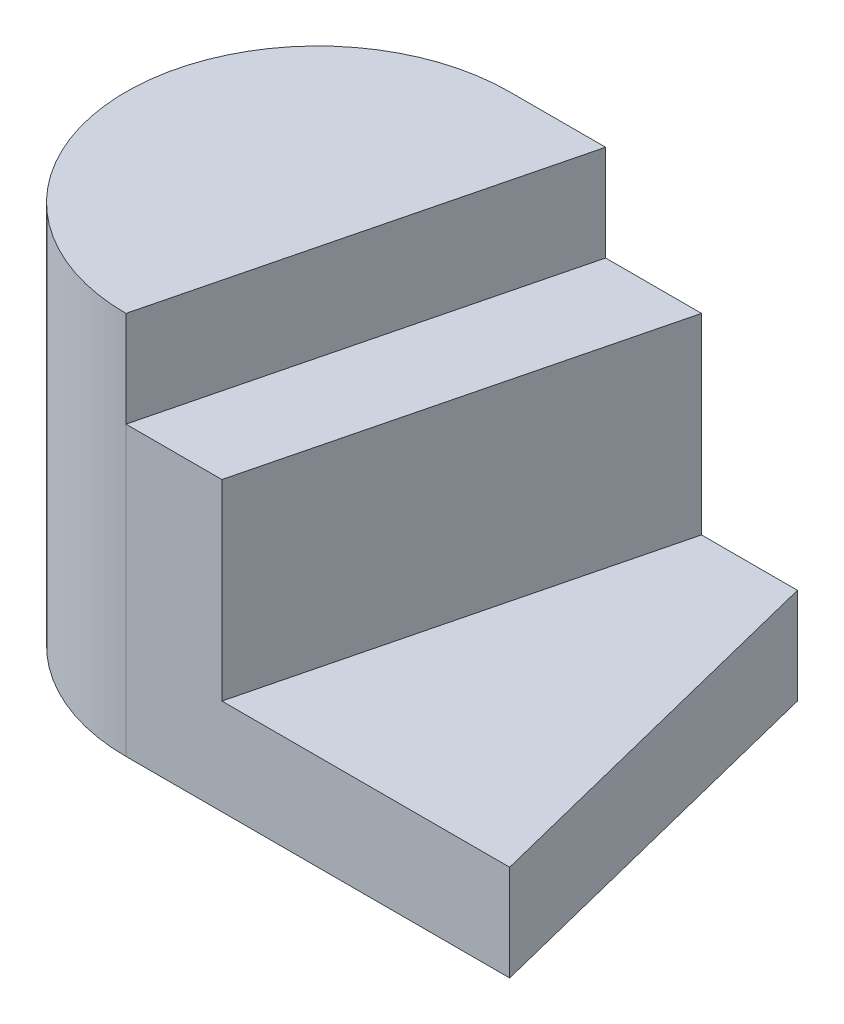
ISO-10303-21;
HEADER;
FILE_DESCRIPTION(('STEP AP214'),'2;1');
FILE_NAME('part.step','',(''),(''),'','','');
FILE_SCHEMA(('AUTOMOTIVE_DESIGN { 1 0 10303 214 1 1 1 1 }'));
ENDSEC;
DATA;
#1=APPLICATION_CONTEXT('core data for automotive mechanical design processes');
#2=APPLICATION_PROTOCOL_DEFINITION('international standard','automotive_design',2000,#1);
#3=PRODUCT_CONTEXT('',#1,'mechanical');
#4=PRODUCT('Part','Part','',(#3));
#5=PRODUCT_RELATED_PRODUCT_CATEGORY('part','',(#4));
#6=PRODUCT_DEFINITION_FORMATION('','',#4);
#7=PRODUCT_DEFINITION_CONTEXT('part definition',#1,'design');
#8=PRODUCT_DEFINITION('design','',#6,#7);
#9=PRODUCT_DEFINITION_SHAPE('','',#8);
#10=(LENGTH_UNIT() NAMED_UNIT(*) SI_UNIT(.MILLI.,.METRE.));
#11=(NAMED_UNIT(*) PLANE_ANGLE_UNIT() SI_UNIT($,.RADIAN.));
#12=(NAMED_UNIT(*) SI_UNIT($,.STERADIAN.) SOLID_ANGLE_UNIT());
#13=UNCERTAINTY_MEASURE_WITH_UNIT(LENGTH_MEASURE(1.E-05),#10,'distance_accuracy_value','');
#14=(GEOMETRIC_REPRESENTATION_CONTEXT(3) GLOBAL_UNCERTAINTY_ASSIGNED_CONTEXT((#13)) GLOBAL_UNIT_ASSIGNED_CONTEXT((#10,
#11,#12)) REPRESENTATION_CONTEXT('',''));
#15=CARTESIAN_POINT('',(0.,0.,0.));
#16=DIRECTION('',(0.,0.,1.));
#17=DIRECTION('',(1.,0.,0.));
#18=AXIS2_PLACEMENT_3D('',#15,#16,#17);
#19=CARTESIAN_POINT('',(-46.230636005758,40.,-20.));
#20=DIRECTION('',(0.,0.,-1.));
#21=DIRECTION('',(-1.,0.,0.));
#22=AXIS2_PLACEMENT_3D('',#19,#20,#21);
#23=PLANE('',#22);
#24=DIRECTION('',(1.,0.,0.));
#25=VECTOR('',#24,1.);
#26=CARTESIAN_POINT('',(-46.230636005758,0.,-20.));
#27=LINE('',#26,#25);
#28=CARTESIAN_POINT('',(0.,0.,-20.));
#29=VERTEX_POINT('',#28);
#30=CARTESIAN_POINT('',(30.,0.,-20.));
#31=VERTEX_POINT('',#30);
#32=EDGE_CURVE('E82',#29,#31,#27,.T.);
#33=ORIENTED_EDGE('',*,*,#32,.F.);
#34=DIRECTION('',(0.,-1.,0.));
#35=VECTOR('',#34,1.);
#36=CARTESIAN_POINT('',(0.,40.,-20.));
#37=LINE('',#36,#35);
#38=CARTESIAN_POINT('',(0.,40.,-20.));
#39=VERTEX_POINT('',#38);
#40=EDGE_CURVE('E11',#39,#29,#37,.T.);
#41=ORIENTED_EDGE('',*,*,#40,.F.);
#42=DIRECTION('',(1.,0.,0.));
#43=VECTOR('',#42,1.);
#44=CARTESIAN_POINT('',(-46.230636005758,40.,-20.));
#45=LINE('',#44,#43);
#46=CARTESIAN_POINT('',(9.99999999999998,40.,-20.));
#47=VERTEX_POINT('',#46);
#48=EDGE_CURVE('E78',#39,#47,#45,.T.);
#49=ORIENTED_EDGE('',*,*,#48,.T.);
#50=DIRECTION('',(0.,-1.,0.));
#51=VECTOR('',#50,1.);
#52=CARTESIAN_POINT('',(9.99999999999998,40.,-20.));
#53=LINE('',#52,#51);
#54=CARTESIAN_POINT('',(9.99999999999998,30.,-20.));
#55=VERTEX_POINT('',#54);
#56=EDGE_CURVE('E48',#47,#55,#53,.T.);
#57=ORIENTED_EDGE('',*,*,#56,.T.);
#58=DIRECTION('',(1.,0.,0.));
#59=VECTOR('',#58,1.);
#60=CARTESIAN_POINT('',(-46.230636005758,30.,-20.));
#61=LINE('',#60,#59);
#62=CARTESIAN_POINT('',(20.,30.,-20.));
#63=VERTEX_POINT('',#62);
#64=EDGE_CURVE('E144',#55,#63,#61,.T.);
#65=ORIENTED_EDGE('',*,*,#64,.T.);
#66=DIRECTION('',(0.,-1.,0.));
#67=VECTOR('',#66,1.);
#68=CARTESIAN_POINT('',(20.,30.,-20.));
#69=LINE('',#68,#67);
#70=CARTESIAN_POINT('',(20.,10.,-20.));
#71=VERTEX_POINT('',#70);
#72=EDGE_CURVE('E69',#63,#71,#69,.T.);
#73=ORIENTED_EDGE('',*,*,#72,.T.);
#74=DIRECTION('',(1.,0.,0.));
#75=VECTOR('',#74,1.);
#76=CARTESIAN_POINT('',(-46.230636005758,10.,-20.));
#77=LINE('',#76,#75);
#78=CARTESIAN_POINT('',(30.,10.,-20.));
#79=VERTEX_POINT('',#78);
#80=EDGE_CURVE('E130',#71,#79,#77,.T.);
#81=ORIENTED_EDGE('',*,*,#80,.T.);
#82=DIRECTION('',(0.,-1.,0.));
#83=VECTOR('',#82,1.);
#84=CARTESIAN_POINT('',(30.,10.,-20.));
#85=LINE('',#84,#83);
#86=EDGE_CURVE('E159',#79,#31,#85,.T.);
#87=ORIENTED_EDGE('',*,*,#86,.T.);
#88=EDGE_LOOP('',(#33,#41,#49,#57,#65,#73,#81,#87));
#89=FACE_BOUND('',#88,.T.);
#90=ADVANCED_FACE('F32',(#89),#23,.T.);
#91=CARTESIAN_POINT('',(0.,40.,0.));
#92=DIRECTION('',(0.,-1.,0.));
#93=DIRECTION('',(0.,0.,-1.));
#94=AXIS2_PLACEMENT_3D('',#91,#92,#93);
#95=CYLINDRICAL_SURFACE('',#94,20.);
#96=CARTESIAN_POINT('',(0.,0.,0.));
#97=DIRECTION('',(0.,1.,0.));
#98=DIRECTION('',(0.,0.,1.));
#99=AXIS2_PLACEMENT_3D('',#96,#97,#98);
#100=CIRCLE('',#99,20.);
#101=CARTESIAN_POINT('',(0.,0.,20.));
#102=VERTEX_POINT('',#101);
#103=EDGE_CURVE('E92',#29,#102,#100,.T.);
#104=ORIENTED_EDGE('',*,*,#103,.T.);
#105=DIRECTION('',(0.,-1.,0.));
#106=VECTOR('',#105,1.);
#107=CARTESIAN_POINT('',(0.,30.,20.));
#108=LINE('',#107,#106);
#109=CARTESIAN_POINT('',(0.,30.,20.));
#110=VERTEX_POINT('',#109);
#111=EDGE_CURVE('E96',#110,#102,#108,.T.);
#112=ORIENTED_EDGE('',*,*,#111,.F.);
#113=DIRECTION('',(0.,-1.,0.));
#114=VECTOR('',#113,1.);
#115=CARTESIAN_POINT('',(0.,40.,20.));
#116=LINE('',#115,#114);
#117=CARTESIAN_POINT('',(0.,40.,20.));
#118=VERTEX_POINT('',#117);
#119=EDGE_CURVE('E40',#118,#110,#116,.T.);
#120=ORIENTED_EDGE('',*,*,#119,.F.);
#121=CARTESIAN_POINT('',(0.,40.,0.));
#122=DIRECTION('',(0.,1.,0.));
#123=DIRECTION('',(0.,0.,1.));
#124=AXIS2_PLACEMENT_3D('',#121,#122,#123);
#125=CIRCLE('',#124,20.);
#126=EDGE_CURVE('E84',#39,#118,#125,.T.);
#127=ORIENTED_EDGE('',*,*,#126,.F.);
#128=ORIENTED_EDGE('',*,*,#40,.T.);
#129=EDGE_LOOP('',(#104,#112,#120,#127,#128));
#130=FACE_BOUND('',#129,.T.);
#131=ADVANCED_FACE('F85',(#130),#95,.T.);
#132=CARTESIAN_POINT('',(1.98643317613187,40.,12.0542672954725));
#133=DIRECTION('',(0.970142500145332,0.,0.242535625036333));
#134=DIRECTION('',(0.242535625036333,0.,-0.970142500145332));
#135=AXIS2_PLACEMENT_3D('',#132,#133,#134);
#136=PLANE('',#135);
#137=DIRECTION('',(-0.242535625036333,0.,0.970142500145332));
#138=VECTOR('',#137,1.);
#139=CARTESIAN_POINT('',(1.98643317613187,30.,12.0542672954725));
#140=LINE('',#139,#138);
#141=EDGE_CURVE('E104',#55,#110,#140,.T.);
#142=ORIENTED_EDGE('',*,*,#141,.F.);
#143=ORIENTED_EDGE('',*,*,#56,.F.);
#144=DIRECTION('',(-0.242535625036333,0.,0.970142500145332));
#145=VECTOR('',#144,1.);
#146=CARTESIAN_POINT('',(1.98643317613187,40.,12.0542672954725));
#147=LINE('',#146,#145);
#148=EDGE_CURVE('E89',#47,#118,#147,.T.);
#149=ORIENTED_EDGE('',*,*,#148,.T.);
#150=ORIENTED_EDGE('',*,*,#119,.T.);
#151=EDGE_LOOP('',(#142,#143,#149,#150));
#152=FACE_BOUND('',#151,.T.);
#153=ADVANCED_FACE('F101',(#152),#136,.T.);
#154=CARTESIAN_POINT('',(-46.230636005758,40.,0.));
#155=DIRECTION('',(0.,1.,0.));
#156=DIRECTION('',(0.,0.,1.));
#157=AXIS2_PLACEMENT_3D('',#154,#155,#156);
#158=PLANE('',#157);
#159=ORIENTED_EDGE('',*,*,#48,.F.);
#160=ORIENTED_EDGE('',*,*,#126,.T.);
#161=ORIENTED_EDGE('',*,*,#148,.F.);
#162=EDGE_LOOP('',(#159,#160,#161));
#163=FACE_BOUND('',#162,.T.);
#164=ADVANCED_FACE('F91',(#163),#158,.T.);
#165=CARTESIAN_POINT('',(-46.230636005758,0.,0.));
#166=DIRECTION('',(0.,1.,0.));
#167=DIRECTION('',(0.,0.,1.));
#168=AXIS2_PLACEMENT_3D('',#165,#166,#167);
#169=PLANE('',#168);
#170=ORIENTED_EDGE('',*,*,#32,.T.);
#171=DIRECTION('',(0.242535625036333,0.,0.970142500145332));
#172=VECTOR('',#171,1.);
#173=CARTESIAN_POINT('',(30.2217272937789,0.,-19.1130908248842));
#174=LINE('',#173,#172);
#175=CARTESIAN_POINT('',(40.,0.,20.));
#176=VERTEX_POINT('',#175);
#177=EDGE_CURVE('E137',#31,#176,#174,.T.);
#178=ORIENTED_EDGE('',*,*,#177,.T.);
#179=DIRECTION('',(-1.,0.,0.));
#180=VECTOR('',#179,1.);
#181=CARTESIAN_POINT('',(-46.230636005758,0.,20.));
#182=LINE('',#181,#180);
#183=EDGE_CURVE('E151',#176,#102,#182,.T.);
#184=ORIENTED_EDGE('',*,*,#183,.T.);
#185=ORIENTED_EDGE('',*,*,#103,.F.);
#186=EDGE_LOOP('',(#170,#178,#184,#185));
#187=FACE_BOUND('',#186,.T.);
#188=ADVANCED_FACE('F170',(#187),#169,.F.);
#189=CARTESIAN_POINT('',(-46.230636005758,30.,20.));
#190=DIRECTION('',(0.,0.,1.));
#191=DIRECTION('',(1.,0.,0.));
#192=AXIS2_PLACEMENT_3D('',#189,#190,#191);
#193=PLANE('',#192);
#194=ORIENTED_EDGE('',*,*,#183,.F.);
#195=DIRECTION('',(0.,-1.,0.));
#196=VECTOR('',#195,1.);
#197=CARTESIAN_POINT('',(40.,10.,20.));
#198=LINE('',#197,#196);
#199=CARTESIAN_POINT('',(40.,10.,20.));
#200=VERTEX_POINT('',#199);
#201=EDGE_CURVE('E152',#200,#176,#198,.T.);
#202=ORIENTED_EDGE('',*,*,#201,.F.);
#203=DIRECTION('',(-1.,0.,0.));
#204=VECTOR('',#203,1.);
#205=CARTESIAN_POINT('',(-46.230636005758,10.,20.));
#206=LINE('',#205,#204);
#207=CARTESIAN_POINT('',(9.99999999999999,10.,20.));
#208=VERTEX_POINT('',#207);
#209=EDGE_CURVE('E142',#200,#208,#206,.T.);
#210=ORIENTED_EDGE('',*,*,#209,.T.);
#211=DIRECTION('',(0.,-1.,0.));
#212=VECTOR('',#211,1.);
#213=CARTESIAN_POINT('',(9.99999999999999,30.,20.));
#214=LINE('',#213,#212);
#215=CARTESIAN_POINT('',(9.99999999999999,30.,20.));
#216=VERTEX_POINT('',#215);
#217=EDGE_CURVE('E141',#216,#208,#214,.T.);
#218=ORIENTED_EDGE('',*,*,#217,.F.);
#219=DIRECTION('',(-1.,0.,0.));
#220=VECTOR('',#219,1.);
#221=CARTESIAN_POINT('',(-46.230636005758,30.,20.));
#222=LINE('',#221,#220);
#223=EDGE_CURVE('E148',#216,#110,#222,.T.);
#224=ORIENTED_EDGE('',*,*,#223,.T.);
#225=ORIENTED_EDGE('',*,*,#111,.T.);
#226=EDGE_LOOP('',(#194,#202,#210,#218,#224,#225));
#227=FACE_BOUND('',#226,.T.);
#228=ADVANCED_FACE('F165',(#227),#193,.T.);
#229=CARTESIAN_POINT('',(11.3981978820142,30.,14.407208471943));
#230=DIRECTION('',(0.970142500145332,0.,0.242535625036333));
#231=DIRECTION('',(0.242535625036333,0.,-0.970142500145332));
#232=AXIS2_PLACEMENT_3D('',#229,#230,#231);
#233=PLANE('',#232);
#234=DIRECTION('',(-0.242535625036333,0.,0.970142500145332));
#235=VECTOR('',#234,1.);
#236=CARTESIAN_POINT('',(11.3981978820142,10.,14.407208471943));
#237=LINE('',#236,#235);
#238=EDGE_CURVE('E133',#71,#208,#237,.T.);
#239=ORIENTED_EDGE('',*,*,#238,.F.);
#240=ORIENTED_EDGE('',*,*,#72,.F.);
#241=DIRECTION('',(-0.242535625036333,0.,0.970142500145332));
#242=VECTOR('',#241,1.);
#243=CARTESIAN_POINT('',(11.3981978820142,30.,14.407208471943));
#244=LINE('',#243,#242);
#245=EDGE_CURVE('E146',#63,#216,#244,.T.);
#246=ORIENTED_EDGE('',*,*,#245,.T.);
#247=ORIENTED_EDGE('',*,*,#217,.T.);
#248=EDGE_LOOP('',(#239,#240,#246,#247));
#249=FACE_BOUND('',#248,.T.);
#250=ADVANCED_FACE('F140',(#249),#233,.T.);
#251=CARTESIAN_POINT('',(-46.230636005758,30.,0.));
#252=DIRECTION('',(0.,1.,0.));
#253=DIRECTION('',(0.,0.,1.));
#254=AXIS2_PLACEMENT_3D('',#251,#252,#253);
#255=PLANE('',#254);
#256=ORIENTED_EDGE('',*,*,#64,.F.);
#257=ORIENTED_EDGE('',*,*,#141,.T.);
#258=ORIENTED_EDGE('',*,*,#223,.F.);
#259=ORIENTED_EDGE('',*,*,#245,.F.);
#260=EDGE_LOOP('',(#256,#257,#258,#259));
#261=FACE_BOUND('',#260,.T.);
#262=ADVANCED_FACE('F172',(#261),#255,.T.);
#263=CARTESIAN_POINT('',(30.2217272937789,10.,-19.1130908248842));
#264=DIRECTION('',(0.970142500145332,0.,-0.242535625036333));
#265=DIRECTION('',(-0.242535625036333,0.,-0.970142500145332));
#266=AXIS2_PLACEMENT_3D('',#263,#264,#265);
#267=PLANE('',#266);
#268=ORIENTED_EDGE('',*,*,#177,.F.);
#269=ORIENTED_EDGE('',*,*,#86,.F.);
#270=DIRECTION('',(0.242535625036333,0.,0.970142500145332));
#271=VECTOR('',#270,1.);
#272=CARTESIAN_POINT('',(30.2217272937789,10.,-19.1130908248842));
#273=LINE('',#272,#271);
#274=EDGE_CURVE('E136',#79,#200,#273,.T.);
#275=ORIENTED_EDGE('',*,*,#274,.T.);
#276=ORIENTED_EDGE('',*,*,#201,.T.);
#277=EDGE_LOOP('',(#268,#269,#275,#276));
#278=FACE_BOUND('',#277,.T.);
#279=ADVANCED_FACE('F168',(#278),#267,.T.);
#280=CARTESIAN_POINT('',(-46.230636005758,10.,0.));
#281=DIRECTION('',(0.,1.,0.));
#282=DIRECTION('',(0.,0.,1.));
#283=AXIS2_PLACEMENT_3D('',#280,#281,#282);
#284=PLANE('',#283);
#285=ORIENTED_EDGE('',*,*,#80,.F.);
#286=ORIENTED_EDGE('',*,*,#238,.T.);
#287=ORIENTED_EDGE('',*,*,#209,.F.);
#288=ORIENTED_EDGE('',*,*,#274,.F.);
#289=EDGE_LOOP('',(#285,#286,#287,#288));
#290=FACE_BOUND('',#289,.T.);
#291=ADVANCED_FACE('F131',(#290),#284,.T.);
#292=CLOSED_SHELL('',(#90,#131,#153,#164,#188,#228,#250,#262,#279,#291));
#293=MANIFOLD_SOLID_BREP('B2',#292);
#294=ADVANCED_BREP_SHAPE_REPRESENTATION('',(#18,#293),#14);
#295=SHAPE_DEFINITION_REPRESENTATION(#9,#294);
ENDSEC;
END-ISO-10303-21;
